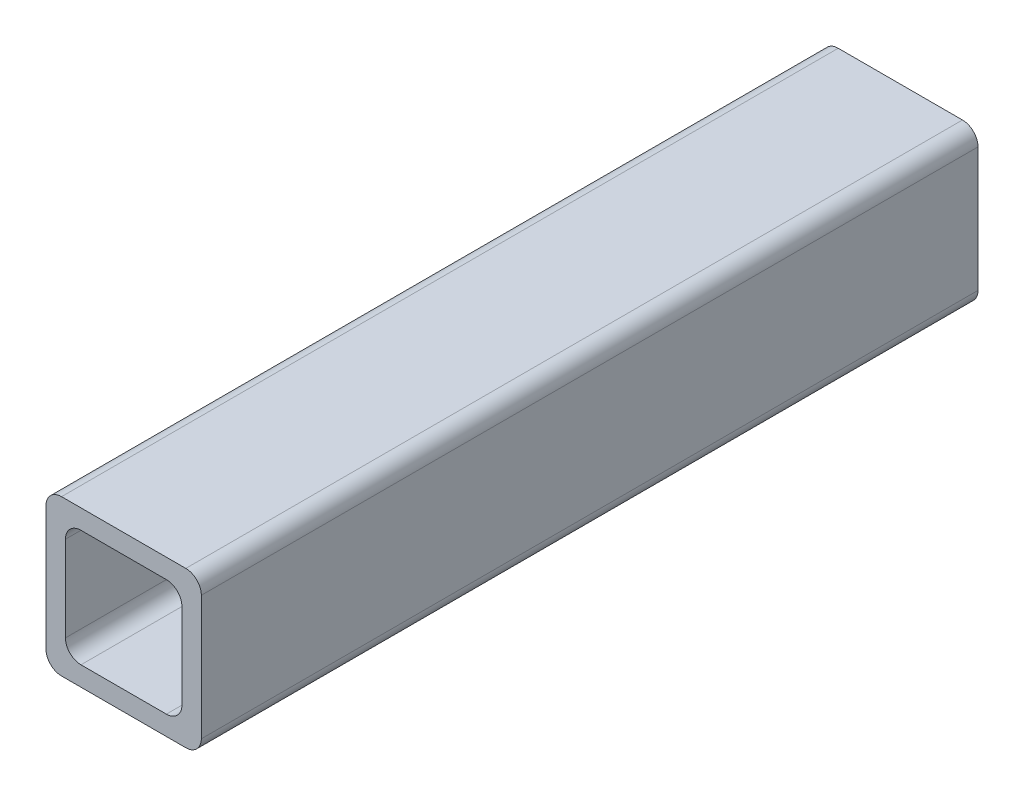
ISO-10303-21;
HEADER;
FILE_DESCRIPTION(('STEP AP214'),'2;1');
FILE_NAME('part.step','',(''),(''),'','','');
FILE_SCHEMA(('AUTOMOTIVE_DESIGN { 1 0 10303 214 1 1 1 1 }'));
ENDSEC;
DATA;
#1=APPLICATION_CONTEXT('core data for automotive mechanical design processes');
#2=APPLICATION_PROTOCOL_DEFINITION('international standard','automotive_design',2000,#1);
#3=PRODUCT_CONTEXT('',#1,'mechanical');
#4=PRODUCT('Part','Part','',(#3));
#5=PRODUCT_RELATED_PRODUCT_CATEGORY('part','',(#4));
#6=PRODUCT_DEFINITION_FORMATION('','',#4);
#7=PRODUCT_DEFINITION_CONTEXT('part definition',#1,'design');
#8=PRODUCT_DEFINITION('design','',#6,#7);
#9=PRODUCT_DEFINITION_SHAPE('','',#8);
#10=(LENGTH_UNIT() NAMED_UNIT(*) SI_UNIT(.MILLI.,.METRE.));
#11=(NAMED_UNIT(*) PLANE_ANGLE_UNIT() SI_UNIT($,.RADIAN.));
#12=(NAMED_UNIT(*) SI_UNIT($,.STERADIAN.) SOLID_ANGLE_UNIT());
#13=UNCERTAINTY_MEASURE_WITH_UNIT(LENGTH_MEASURE(1.E-05),#10,'distance_accuracy_value','');
#14=(GEOMETRIC_REPRESENTATION_CONTEXT(3) GLOBAL_UNCERTAINTY_ASSIGNED_CONTEXT((#13)) GLOBAL_UNIT_ASSIGNED_CONTEXT((#10,
#11,#12)) REPRESENTATION_CONTEXT('',''));
#15=CARTESIAN_POINT('',(0.,0.,0.));
#16=DIRECTION('',(0.,0.,1.));
#17=DIRECTION('',(1.,0.,0.));
#18=AXIS2_PLACEMENT_3D('',#15,#16,#17);
#19=CARTESIAN_POINT('',(-9.50097337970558,-8.,100.));
#20=DIRECTION('',(0.,0.,-1.));
#21=DIRECTION('',(-1.,0.,0.));
#22=AXIS2_PLACEMENT_3D('',#19,#20,#21);
#23=PLANE('',#22);
#24=CARTESIAN_POINT('',(-9.50097337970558,-8.,100.));
#25=DIRECTION('',(0.,0.,1.));
#26=DIRECTION('',(-1.,0.,0.));
#27=AXIS2_PLACEMENT_3D('',#24,#25,#26);
#28=CIRCLE('',#27,2.);
#29=CARTESIAN_POINT('',(-11.5009733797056,-7.99999999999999,100.));
#30=VERTEX_POINT('',#29);
#31=CARTESIAN_POINT('',(-9.50097337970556,-10.,100.));
#32=VERTEX_POINT('',#31);
#33=EDGE_CURVE('E211',#30,#32,#28,.T.);
#34=ORIENTED_EDGE('',*,*,#33,.T.);
#35=DIRECTION('',(1.,0.,0.));
#36=VECTOR('',#35,1.);
#37=CARTESIAN_POINT('',(6.49902662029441,-10.,100.));
#38=LINE('',#37,#36);
#39=CARTESIAN_POINT('',(6.49902662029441,-10.,100.));
#40=VERTEX_POINT('',#39);
#41=EDGE_CURVE('E214',#32,#40,#38,.T.);
#42=ORIENTED_EDGE('',*,*,#41,.T.);
#43=CARTESIAN_POINT('',(6.49902662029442,-8.,100.));
#44=DIRECTION('',(0.,0.,1.));
#45=DIRECTION('',(1.,0.,0.));
#46=AXIS2_PLACEMENT_3D('',#43,#44,#45);
#47=CIRCLE('',#46,2.);
#48=CARTESIAN_POINT('',(8.49902662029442,-7.99999999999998,100.));
#49=VERTEX_POINT('',#48);
#50=EDGE_CURVE('E217',#40,#49,#47,.T.);
#51=ORIENTED_EDGE('',*,*,#50,.T.);
#52=DIRECTION('',(0.,1.,0.));
#53=VECTOR('',#52,1.);
#54=CARTESIAN_POINT('',(8.49902662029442,-7.99999999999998,100.));
#55=LINE('',#54,#53);
#56=CARTESIAN_POINT('',(8.49902662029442,7.99999999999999,100.));
#57=VERTEX_POINT('',#56);
#58=EDGE_CURVE('E219',#49,#57,#55,.T.);
#59=ORIENTED_EDGE('',*,*,#58,.T.);
#60=CARTESIAN_POINT('',(6.49902662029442,8.,100.));
#61=DIRECTION('',(0.,0.,1.));
#62=DIRECTION('',(1.,0.,0.));
#63=AXIS2_PLACEMENT_3D('',#60,#61,#62);
#64=CIRCLE('',#63,2.);
#65=CARTESIAN_POINT('',(6.49902662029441,10.,100.));
#66=VERTEX_POINT('',#65);
#67=EDGE_CURVE('E221',#57,#66,#64,.T.);
#68=ORIENTED_EDGE('',*,*,#67,.T.);
#69=DIRECTION('',(-1.,0.,0.));
#70=VECTOR('',#69,1.);
#71=CARTESIAN_POINT('',(6.49902662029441,10.,100.));
#72=LINE('',#71,#70);
#73=CARTESIAN_POINT('',(-9.50097337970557,10.,100.));
#74=VERTEX_POINT('',#73);
#75=EDGE_CURVE('E223',#66,#74,#72,.T.);
#76=ORIENTED_EDGE('',*,*,#75,.T.);
#77=CARTESIAN_POINT('',(-9.50097337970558,8.,100.));
#78=DIRECTION('',(0.,0.,1.));
#79=DIRECTION('',(1.,0.,0.));
#80=AXIS2_PLACEMENT_3D('',#77,#78,#79);
#81=CIRCLE('',#80,2.);
#82=CARTESIAN_POINT('',(-11.5009733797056,7.99999999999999,100.));
#83=VERTEX_POINT('',#82);
#84=EDGE_CURVE('E225',#74,#83,#81,.T.);
#85=ORIENTED_EDGE('',*,*,#84,.T.);
#86=DIRECTION('',(0.,-1.,0.));
#87=VECTOR('',#86,1.);
#88=CARTESIAN_POINT('',(-11.5009733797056,-7.99999999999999,100.));
#89=LINE('',#88,#87);
#90=EDGE_CURVE('E227',#83,#30,#89,.T.);
#91=ORIENTED_EDGE('',*,*,#90,.T.);
#92=EDGE_LOOP('',(#34,#42,#51,#59,#68,#76,#85,#91));
#93=FACE_BOUND('',#92,.T.);
#94=CARTESIAN_POINT('',(3.99902662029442,-5.5,100.));
#95=DIRECTION('',(0.,0.,1.));
#96=DIRECTION('',(1.,0.,0.));
#97=AXIS2_PLACEMENT_3D('',#94,#95,#96);
#98=CIRCLE('',#97,2.);
#99=CARTESIAN_POINT('',(3.99902662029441,-7.5,100.));
#100=VERTEX_POINT('',#99);
#101=CARTESIAN_POINT('',(5.99902662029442,-5.49999999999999,100.));
#102=VERTEX_POINT('',#101);
#103=EDGE_CURVE('E146',#100,#102,#98,.T.);
#104=ORIENTED_EDGE('',*,*,#103,.F.);
#105=DIRECTION('',(1.,0.,0.));
#106=VECTOR('',#105,1.);
#107=CARTESIAN_POINT('',(3.99902662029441,-7.5,100.));
#108=LINE('',#107,#106);
#109=CARTESIAN_POINT('',(-7.00097337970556,-7.5,100.));
#110=VERTEX_POINT('',#109);
#111=EDGE_CURVE('E179',#110,#100,#108,.T.);
#112=ORIENTED_EDGE('',*,*,#111,.F.);
#113=CARTESIAN_POINT('',(-7.00097337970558,-5.5,100.));
#114=DIRECTION('',(0.,0.,1.));
#115=DIRECTION('',(1.,0.,0.));
#116=AXIS2_PLACEMENT_3D('',#113,#114,#115);
#117=CIRCLE('',#116,2.);
#118=CARTESIAN_POINT('',(-9.00097337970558,-5.49999999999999,100.));
#119=VERTEX_POINT('',#118);
#120=EDGE_CURVE('E177',#119,#110,#117,.T.);
#121=ORIENTED_EDGE('',*,*,#120,.F.);
#122=DIRECTION('',(0.,-1.,0.));
#123=VECTOR('',#122,1.);
#124=CARTESIAN_POINT('',(-9.00097337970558,-5.49999999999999,100.));
#125=LINE('',#124,#123);
#126=CARTESIAN_POINT('',(-9.00097337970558,5.49999999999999,100.));
#127=VERTEX_POINT('',#126);
#128=EDGE_CURVE('E175',#127,#119,#125,.T.);
#129=ORIENTED_EDGE('',*,*,#128,.F.);
#130=CARTESIAN_POINT('',(-7.00097337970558,5.5,100.));
#131=DIRECTION('',(0.,0.,1.));
#132=DIRECTION('',(1.,0.,0.));
#133=AXIS2_PLACEMENT_3D('',#130,#131,#132);
#134=CIRCLE('',#133,2.);
#135=CARTESIAN_POINT('',(-7.00097337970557,7.5,100.));
#136=VERTEX_POINT('',#135);
#137=EDGE_CURVE('E173',#136,#127,#134,.T.);
#138=ORIENTED_EDGE('',*,*,#137,.F.);
#139=DIRECTION('',(-1.,0.,0.));
#140=VECTOR('',#139,1.);
#141=CARTESIAN_POINT('',(3.99902662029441,7.5,100.));
#142=LINE('',#141,#140);
#143=CARTESIAN_POINT('',(3.99902662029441,7.5,100.));
#144=VERTEX_POINT('',#143);
#145=EDGE_CURVE('E169',#144,#136,#142,.T.);
#146=ORIENTED_EDGE('',*,*,#145,.F.);
#147=CARTESIAN_POINT('',(3.99902662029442,5.5,100.));
#148=DIRECTION('',(0.,0.,1.));
#149=DIRECTION('',(-1.,0.,0.));
#150=AXIS2_PLACEMENT_3D('',#147,#148,#149);
#151=CIRCLE('',#150,2.);
#152=CARTESIAN_POINT('',(5.99902662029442,5.49999999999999,100.));
#153=VERTEX_POINT('',#152);
#154=EDGE_CURVE('E167',#153,#144,#151,.T.);
#155=ORIENTED_EDGE('',*,*,#154,.F.);
#156=DIRECTION('',(0.,1.,0.));
#157=VECTOR('',#156,1.);
#158=CARTESIAN_POINT('',(5.99902662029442,-5.49999999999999,100.));
#159=LINE('',#158,#157);
#160=EDGE_CURVE('E154',#102,#153,#159,.T.);
#161=ORIENTED_EDGE('',*,*,#160,.F.);
#162=EDGE_LOOP('',(#104,#112,#121,#129,#138,#146,#155,#161));
#163=FACE_BOUND('',#162,.T.);
#164=ADVANCED_FACE('F33',(#93,#163),#23,.F.);
#165=CARTESIAN_POINT('',(-9.50097337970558,-8.,0.));
#166=DIRECTION('',(0.,0.,-1.));
#167=DIRECTION('',(-1.,0.,0.));
#168=AXIS2_PLACEMENT_3D('',#165,#166,#167);
#169=PLANE('',#168);
#170=CARTESIAN_POINT('',(-9.50097337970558,-8.,0.));
#171=DIRECTION('',(0.,0.,1.));
#172=DIRECTION('',(-1.,0.,0.));
#173=AXIS2_PLACEMENT_3D('',#170,#171,#172);
#174=CIRCLE('',#173,2.);
#175=CARTESIAN_POINT('',(-11.5009733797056,-7.99999999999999,0.));
#176=VERTEX_POINT('',#175);
#177=CARTESIAN_POINT('',(-9.50097337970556,-10.,0.));
#178=VERTEX_POINT('',#177);
#179=EDGE_CURVE('E162',#176,#178,#174,.T.);
#180=ORIENTED_EDGE('',*,*,#179,.F.);
#181=DIRECTION('',(0.,-1.,0.));
#182=VECTOR('',#181,1.);
#183=CARTESIAN_POINT('',(-11.5009733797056,-7.99999999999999,0.));
#184=LINE('',#183,#182);
#185=CARTESIAN_POINT('',(-11.5009733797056,7.99999999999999,0.));
#186=VERTEX_POINT('',#185);
#187=EDGE_CURVE('E215',#186,#176,#184,.T.);
#188=ORIENTED_EDGE('',*,*,#187,.F.);
#189=CARTESIAN_POINT('',(-9.50097337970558,8.,0.));
#190=DIRECTION('',(0.,0.,1.));
#191=DIRECTION('',(1.,0.,0.));
#192=AXIS2_PLACEMENT_3D('',#189,#190,#191);
#193=CIRCLE('',#192,2.);
#194=CARTESIAN_POINT('',(-9.50097337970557,10.,0.));
#195=VERTEX_POINT('',#194);
#196=EDGE_CURVE('E242',#195,#186,#193,.T.);
#197=ORIENTED_EDGE('',*,*,#196,.F.);
#198=DIRECTION('',(-1.,0.,0.));
#199=VECTOR('',#198,1.);
#200=CARTESIAN_POINT('',(6.49902662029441,10.,0.));
#201=LINE('',#200,#199);
#202=CARTESIAN_POINT('',(6.49902662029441,10.,0.));
#203=VERTEX_POINT('',#202);
#204=EDGE_CURVE('E240',#203,#195,#201,.T.);
#205=ORIENTED_EDGE('',*,*,#204,.F.);
#206=CARTESIAN_POINT('',(6.49902662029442,8.,0.));
#207=DIRECTION('',(0.,0.,1.));
#208=DIRECTION('',(1.,0.,0.));
#209=AXIS2_PLACEMENT_3D('',#206,#207,#208);
#210=CIRCLE('',#209,2.);
#211=CARTESIAN_POINT('',(8.49902662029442,7.99999999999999,0.));
#212=VERTEX_POINT('',#211);
#213=EDGE_CURVE('E238',#212,#203,#210,.T.);
#214=ORIENTED_EDGE('',*,*,#213,.F.);
#215=DIRECTION('',(0.,1.,0.));
#216=VECTOR('',#215,1.);
#217=CARTESIAN_POINT('',(8.49902662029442,-7.99999999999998,0.));
#218=LINE('',#217,#216);
#219=CARTESIAN_POINT('',(8.49902662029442,-7.99999999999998,0.));
#220=VERTEX_POINT('',#219);
#221=EDGE_CURVE('E236',#220,#212,#218,.T.);
#222=ORIENTED_EDGE('',*,*,#221,.F.);
#223=CARTESIAN_POINT('',(6.49902662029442,-8.,0.));
#224=DIRECTION('',(0.,0.,1.));
#225=DIRECTION('',(1.,0.,0.));
#226=AXIS2_PLACEMENT_3D('',#223,#224,#225);
#227=CIRCLE('',#226,2.);
#228=CARTESIAN_POINT('',(6.49902662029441,-10.,0.));
#229=VERTEX_POINT('',#228);
#230=EDGE_CURVE('E234',#229,#220,#227,.T.);
#231=ORIENTED_EDGE('',*,*,#230,.F.);
#232=DIRECTION('',(1.,0.,0.));
#233=VECTOR('',#232,1.);
#234=CARTESIAN_POINT('',(6.49902662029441,-10.,0.));
#235=LINE('',#234,#233);
#236=EDGE_CURVE('E232',#178,#229,#235,.T.);
#237=ORIENTED_EDGE('',*,*,#236,.F.);
#238=EDGE_LOOP('',(#180,#188,#197,#205,#214,#222,#231,#237));
#239=FACE_BOUND('',#238,.T.);
#240=DIRECTION('',(1.,0.,0.));
#241=VECTOR('',#240,1.);
#242=CARTESIAN_POINT('',(3.99902662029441,-7.5,0.));
#243=LINE('',#242,#241);
#244=CARTESIAN_POINT('',(-7.00097337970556,-7.5,0.));
#245=VERTEX_POINT('',#244);
#246=CARTESIAN_POINT('',(3.99902662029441,-7.5,0.));
#247=VERTEX_POINT('',#246);
#248=EDGE_CURVE('E155',#245,#247,#243,.T.);
#249=ORIENTED_EDGE('',*,*,#248,.T.);
#250=CARTESIAN_POINT('',(3.99902662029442,-5.5,0.));
#251=DIRECTION('',(0.,0.,1.));
#252=DIRECTION('',(1.,0.,0.));
#253=AXIS2_PLACEMENT_3D('',#250,#251,#252);
#254=CIRCLE('',#253,2.);
#255=CARTESIAN_POINT('',(5.99902662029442,-5.49999999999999,0.));
#256=VERTEX_POINT('',#255);
#257=EDGE_CURVE('E56',#247,#256,#254,.T.);
#258=ORIENTED_EDGE('',*,*,#257,.T.);
#259=DIRECTION('',(0.,1.,0.));
#260=VECTOR('',#259,1.);
#261=CARTESIAN_POINT('',(5.99902662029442,-5.49999999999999,0.));
#262=LINE('',#261,#260);
#263=CARTESIAN_POINT('',(5.99902662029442,5.49999999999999,0.));
#264=VERTEX_POINT('',#263);
#265=EDGE_CURVE('E161',#256,#264,#262,.T.);
#266=ORIENTED_EDGE('',*,*,#265,.T.);
#267=CARTESIAN_POINT('',(3.99902662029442,5.5,0.));
#268=DIRECTION('',(0.,0.,1.));
#269=DIRECTION('',(-1.,0.,0.));
#270=AXIS2_PLACEMENT_3D('',#267,#268,#269);
#271=CIRCLE('',#270,2.);
#272=CARTESIAN_POINT('',(3.99902662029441,7.5,0.));
#273=VERTEX_POINT('',#272);
#274=EDGE_CURVE('E183',#264,#273,#271,.T.);
#275=ORIENTED_EDGE('',*,*,#274,.T.);
#276=DIRECTION('',(-1.,0.,0.));
#277=VECTOR('',#276,1.);
#278=CARTESIAN_POINT('',(3.99902662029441,7.5,0.));
#279=LINE('',#278,#277);
#280=CARTESIAN_POINT('',(-7.00097337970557,7.5,0.));
#281=VERTEX_POINT('',#280);
#282=EDGE_CURVE('E186',#273,#281,#279,.T.);
#283=ORIENTED_EDGE('',*,*,#282,.T.);
#284=CARTESIAN_POINT('',(-7.00097337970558,5.5,0.));
#285=DIRECTION('',(0.,0.,1.));
#286=DIRECTION('',(1.,0.,0.));
#287=AXIS2_PLACEMENT_3D('',#284,#285,#286);
#288=CIRCLE('',#287,2.);
#289=CARTESIAN_POINT('',(-9.00097337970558,5.49999999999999,0.));
#290=VERTEX_POINT('',#289);
#291=EDGE_CURVE('E189',#281,#290,#288,.T.);
#292=ORIENTED_EDGE('',*,*,#291,.T.);
#293=DIRECTION('',(0.,-1.,0.));
#294=VECTOR('',#293,1.);
#295=CARTESIAN_POINT('',(-9.00097337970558,-5.49999999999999,0.));
#296=LINE('',#295,#294);
#297=CARTESIAN_POINT('',(-9.00097337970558,-5.49999999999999,0.));
#298=VERTEX_POINT('',#297);
#299=EDGE_CURVE('E192',#290,#298,#296,.T.);
#300=ORIENTED_EDGE('',*,*,#299,.T.);
#301=CARTESIAN_POINT('',(-7.00097337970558,-5.5,0.));
#302=DIRECTION('',(0.,0.,1.));
#303=DIRECTION('',(1.,0.,0.));
#304=AXIS2_PLACEMENT_3D('',#301,#302,#303);
#305=CIRCLE('',#304,2.);
#306=EDGE_CURVE('E195',#298,#245,#305,.T.);
#307=ORIENTED_EDGE('',*,*,#306,.T.);
#308=EDGE_LOOP('',(#249,#258,#266,#275,#283,#292,#300,#307));
#309=FACE_BOUND('',#308,.T.);
#310=ADVANCED_FACE('F272',(#239,#309),#169,.T.);
#311=CARTESIAN_POINT('',(-9.50097337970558,-8.,100.));
#312=DIRECTION('',(0.,0.,-1.));
#313=DIRECTION('',(-1.,0.,0.));
#314=AXIS2_PLACEMENT_3D('',#311,#312,#313);
#315=CYLINDRICAL_SURFACE('',#314,2.);
#316=ORIENTED_EDGE('',*,*,#179,.T.);
#317=DIRECTION('',(0.,0.,-1.));
#318=VECTOR('',#317,1.);
#319=CARTESIAN_POINT('',(-9.50097337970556,-10.,100.));
#320=LINE('',#319,#318);
#321=EDGE_CURVE('E11',#32,#178,#320,.T.);
#322=ORIENTED_EDGE('',*,*,#321,.F.);
#323=ORIENTED_EDGE('',*,*,#33,.F.);
#324=DIRECTION('',(0.,0.,-1.));
#325=VECTOR('',#324,1.);
#326=CARTESIAN_POINT('',(-11.5009733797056,-7.99999999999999,100.));
#327=LINE('',#326,#325);
#328=EDGE_CURVE('E229',#30,#176,#327,.T.);
#329=ORIENTED_EDGE('',*,*,#328,.T.);
#330=EDGE_LOOP('',(#316,#322,#323,#329));
#331=FACE_BOUND('',#330,.T.);
#332=ADVANCED_FACE('F35',(#331),#315,.T.);
#333=CARTESIAN_POINT('',(6.49902662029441,-10.,100.));
#334=DIRECTION('',(0.,1.,0.));
#335=DIRECTION('',(-1.,0.,0.));
#336=AXIS2_PLACEMENT_3D('',#333,#334,#335);
#337=PLANE('',#336);
#338=ORIENTED_EDGE('',*,*,#236,.T.);
#339=DIRECTION('',(0.,0.,-1.));
#340=VECTOR('',#339,1.);
#341=CARTESIAN_POINT('',(6.49902662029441,-10.,100.));
#342=LINE('',#341,#340);
#343=EDGE_CURVE('E41',#40,#229,#342,.T.);
#344=ORIENTED_EDGE('',*,*,#343,.F.);
#345=ORIENTED_EDGE('',*,*,#41,.F.);
#346=ORIENTED_EDGE('',*,*,#321,.T.);
#347=EDGE_LOOP('',(#338,#344,#345,#346));
#348=FACE_BOUND('',#347,.T.);
#349=ADVANCED_FACE('F289',(#348),#337,.F.);
#350=CARTESIAN_POINT('',(6.49902662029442,-8.,100.));
#351=DIRECTION('',(0.,0.,-1.));
#352=DIRECTION('',(-1.,0.,0.));
#353=AXIS2_PLACEMENT_3D('',#350,#351,#352);
#354=CYLINDRICAL_SURFACE('',#353,2.);
#355=ORIENTED_EDGE('',*,*,#230,.T.);
#356=DIRECTION('',(0.,0.,-1.));
#357=VECTOR('',#356,1.);
#358=CARTESIAN_POINT('',(8.49902662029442,-7.99999999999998,100.));
#359=LINE('',#358,#357);
#360=EDGE_CURVE('E259',#49,#220,#359,.T.);
#361=ORIENTED_EDGE('',*,*,#360,.F.);
#362=ORIENTED_EDGE('',*,*,#50,.F.);
#363=ORIENTED_EDGE('',*,*,#343,.T.);
#364=EDGE_LOOP('',(#355,#361,#362,#363));
#365=FACE_BOUND('',#364,.T.);
#366=ADVANCED_FACE('F266',(#365),#354,.T.);
#367=CARTESIAN_POINT('',(8.49902662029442,-7.99999999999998,100.));
#368=DIRECTION('',(-1.,0.,0.));
#369=DIRECTION('',(0.,0.,1.));
#370=AXIS2_PLACEMENT_3D('',#367,#368,#369);
#371=PLANE('',#370);
#372=ORIENTED_EDGE('',*,*,#221,.T.);
#373=DIRECTION('',(0.,0.,-1.));
#374=VECTOR('',#373,1.);
#375=CARTESIAN_POINT('',(8.49902662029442,7.99999999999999,100.));
#376=LINE('',#375,#374);
#377=EDGE_CURVE('E256',#57,#212,#376,.T.);
#378=ORIENTED_EDGE('',*,*,#377,.F.);
#379=ORIENTED_EDGE('',*,*,#58,.F.);
#380=ORIENTED_EDGE('',*,*,#360,.T.);
#381=EDGE_LOOP('',(#372,#378,#379,#380));
#382=FACE_BOUND('',#381,.T.);
#383=ADVANCED_FACE('F278',(#382),#371,.F.);
#384=CARTESIAN_POINT('',(6.49902662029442,8.,100.));
#385=DIRECTION('',(0.,0.,-1.));
#386=DIRECTION('',(-1.,0.,0.));
#387=AXIS2_PLACEMENT_3D('',#384,#385,#386);
#388=CYLINDRICAL_SURFACE('',#387,2.);
#389=ORIENTED_EDGE('',*,*,#213,.T.);
#390=DIRECTION('',(0.,0.,-1.));
#391=VECTOR('',#390,1.);
#392=CARTESIAN_POINT('',(6.49902662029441,10.,100.));
#393=LINE('',#392,#391);
#394=EDGE_CURVE('E253',#66,#203,#393,.T.);
#395=ORIENTED_EDGE('',*,*,#394,.F.);
#396=ORIENTED_EDGE('',*,*,#67,.F.);
#397=ORIENTED_EDGE('',*,*,#377,.T.);
#398=EDGE_LOOP('',(#389,#395,#396,#397));
#399=FACE_BOUND('',#398,.T.);
#400=ADVANCED_FACE('F282',(#399),#388,.T.);
#401=CARTESIAN_POINT('',(6.49902662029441,10.,100.));
#402=DIRECTION('',(0.,-1.,0.));
#403=DIRECTION('',(1.,0.,0.));
#404=AXIS2_PLACEMENT_3D('',#401,#402,#403);
#405=PLANE('',#404);
#406=ORIENTED_EDGE('',*,*,#204,.T.);
#407=DIRECTION('',(0.,0.,-1.));
#408=VECTOR('',#407,1.);
#409=CARTESIAN_POINT('',(-9.50097337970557,10.,100.));
#410=LINE('',#409,#408);
#411=EDGE_CURVE('E250',#74,#195,#410,.T.);
#412=ORIENTED_EDGE('',*,*,#411,.F.);
#413=ORIENTED_EDGE('',*,*,#75,.F.);
#414=ORIENTED_EDGE('',*,*,#394,.T.);
#415=EDGE_LOOP('',(#406,#412,#413,#414));
#416=FACE_BOUND('',#415,.T.);
#417=ADVANCED_FACE('F302',(#416),#405,.F.);
#418=CARTESIAN_POINT('',(-9.50097337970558,8.,100.));
#419=DIRECTION('',(0.,0.,-1.));
#420=DIRECTION('',(-1.,0.,0.));
#421=AXIS2_PLACEMENT_3D('',#418,#419,#420);
#422=CYLINDRICAL_SURFACE('',#421,2.);
#423=ORIENTED_EDGE('',*,*,#196,.T.);
#424=DIRECTION('',(0.,0.,-1.));
#425=VECTOR('',#424,1.);
#426=CARTESIAN_POINT('',(-11.5009733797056,7.99999999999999,100.));
#427=LINE('',#426,#425);
#428=EDGE_CURVE('E247',#83,#186,#427,.T.);
#429=ORIENTED_EDGE('',*,*,#428,.F.);
#430=ORIENTED_EDGE('',*,*,#84,.F.);
#431=ORIENTED_EDGE('',*,*,#411,.T.);
#432=EDGE_LOOP('',(#423,#429,#430,#431));
#433=FACE_BOUND('',#432,.T.);
#434=ADVANCED_FACE('F300',(#433),#422,.T.);
#435=CARTESIAN_POINT('',(-11.5009733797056,-7.99999999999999,100.));
#436=DIRECTION('',(1.,0.,0.));
#437=DIRECTION('',(0.,0.,-1.));
#438=AXIS2_PLACEMENT_3D('',#435,#436,#437);
#439=PLANE('',#438);
#440=ORIENTED_EDGE('',*,*,#187,.T.);
#441=ORIENTED_EDGE('',*,*,#328,.F.);
#442=ORIENTED_EDGE('',*,*,#90,.F.);
#443=ORIENTED_EDGE('',*,*,#428,.T.);
#444=EDGE_LOOP('',(#440,#441,#442,#443));
#445=FACE_BOUND('',#444,.T.);
#446=ADVANCED_FACE('F295',(#445),#439,.F.);
#447=CARTESIAN_POINT('',(3.99902662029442,-5.5,100.));
#448=DIRECTION('',(0.,0.,-1.));
#449=DIRECTION('',(-1.,0.,0.));
#450=AXIS2_PLACEMENT_3D('',#447,#448,#449);
#451=CYLINDRICAL_SURFACE('',#450,2.);
#452=ORIENTED_EDGE('',*,*,#257,.F.);
#453=DIRECTION('',(0.,0.,-1.));
#454=VECTOR('',#453,1.);
#455=CARTESIAN_POINT('',(3.99902662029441,-7.5,100.));
#456=LINE('',#455,#454);
#457=EDGE_CURVE('E150',#100,#247,#456,.T.);
#458=ORIENTED_EDGE('',*,*,#457,.F.);
#459=ORIENTED_EDGE('',*,*,#103,.T.);
#460=DIRECTION('',(0.,0.,-1.));
#461=VECTOR('',#460,1.);
#462=CARTESIAN_POINT('',(5.99902662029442,-5.49999999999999,100.));
#463=LINE('',#462,#461);
#464=EDGE_CURVE('E149',#102,#256,#463,.T.);
#465=ORIENTED_EDGE('',*,*,#464,.T.);
#466=EDGE_LOOP('',(#452,#458,#459,#465));
#467=FACE_BOUND('',#466,.T.);
#468=ADVANCED_FACE('F148',(#467),#451,.F.);
#469=CARTESIAN_POINT('',(5.99902662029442,-5.49999999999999,100.));
#470=DIRECTION('',(-1.,0.,0.));
#471=DIRECTION('',(0.,0.,1.));
#472=AXIS2_PLACEMENT_3D('',#469,#470,#471);
#473=PLANE('',#472);
#474=ORIENTED_EDGE('',*,*,#265,.F.);
#475=ORIENTED_EDGE('',*,*,#464,.F.);
#476=ORIENTED_EDGE('',*,*,#160,.T.);
#477=DIRECTION('',(0.,0.,-1.));
#478=VECTOR('',#477,1.);
#479=CARTESIAN_POINT('',(5.99902662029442,5.49999999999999,100.));
#480=LINE('',#479,#478);
#481=EDGE_CURVE('E163',#153,#264,#480,.T.);
#482=ORIENTED_EDGE('',*,*,#481,.T.);
#483=EDGE_LOOP('',(#474,#475,#476,#482));
#484=FACE_BOUND('',#483,.T.);
#485=ADVANCED_FACE('F158',(#484),#473,.T.);
#486=CARTESIAN_POINT('',(3.99902662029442,5.5,100.));
#487=DIRECTION('',(0.,0.,-1.));
#488=DIRECTION('',(-1.,0.,0.));
#489=AXIS2_PLACEMENT_3D('',#486,#487,#488);
#490=CYLINDRICAL_SURFACE('',#489,2.);
#491=ORIENTED_EDGE('',*,*,#274,.F.);
#492=ORIENTED_EDGE('',*,*,#481,.F.);
#493=ORIENTED_EDGE('',*,*,#154,.T.);
#494=DIRECTION('',(0.,0.,-1.));
#495=VECTOR('',#494,1.);
#496=CARTESIAN_POINT('',(3.99902662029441,7.5,100.));
#497=LINE('',#496,#495);
#498=EDGE_CURVE('E208',#144,#273,#497,.T.);
#499=ORIENTED_EDGE('',*,*,#498,.T.);
#500=EDGE_LOOP('',(#491,#492,#493,#499));
#501=FACE_BOUND('',#500,.T.);
#502=ADVANCED_FACE('F327',(#501),#490,.F.);
#503=CARTESIAN_POINT('',(3.99902662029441,7.5,100.));
#504=DIRECTION('',(0.,-1.,0.));
#505=DIRECTION('',(1.,0.,0.));
#506=AXIS2_PLACEMENT_3D('',#503,#504,#505);
#507=PLANE('',#506);
#508=ORIENTED_EDGE('',*,*,#282,.F.);
#509=ORIENTED_EDGE('',*,*,#498,.F.);
#510=ORIENTED_EDGE('',*,*,#145,.T.);
#511=DIRECTION('',(0.,0.,-1.));
#512=VECTOR('',#511,1.);
#513=CARTESIAN_POINT('',(-7.00097337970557,7.5,100.));
#514=LINE('',#513,#512);
#515=EDGE_CURVE('E206',#136,#281,#514,.T.);
#516=ORIENTED_EDGE('',*,*,#515,.T.);
#517=EDGE_LOOP('',(#508,#509,#510,#516));
#518=FACE_BOUND('',#517,.T.);
#519=ADVANCED_FACE('F331',(#518),#507,.T.);
#520=CARTESIAN_POINT('',(-7.00097337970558,5.5,100.));
#521=DIRECTION('',(0.,0.,-1.));
#522=DIRECTION('',(-1.,0.,0.));
#523=AXIS2_PLACEMENT_3D('',#520,#521,#522);
#524=CYLINDRICAL_SURFACE('',#523,2.);
#525=ORIENTED_EDGE('',*,*,#291,.F.);
#526=ORIENTED_EDGE('',*,*,#515,.F.);
#527=ORIENTED_EDGE('',*,*,#137,.T.);
#528=DIRECTION('',(0.,0.,-1.));
#529=VECTOR('',#528,1.);
#530=CARTESIAN_POINT('',(-9.00097337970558,5.49999999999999,100.));
#531=LINE('',#530,#529);
#532=EDGE_CURVE('E204',#127,#290,#531,.T.);
#533=ORIENTED_EDGE('',*,*,#532,.T.);
#534=EDGE_LOOP('',(#525,#526,#527,#533));
#535=FACE_BOUND('',#534,.T.);
#536=ADVANCED_FACE('F337',(#535),#524,.F.);
#537=CARTESIAN_POINT('',(-9.00097337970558,-5.49999999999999,100.));
#538=DIRECTION('',(1.,0.,0.));
#539=DIRECTION('',(0.,1.,0.));
#540=AXIS2_PLACEMENT_3D('',#537,#538,#539);
#541=PLANE('',#540);
#542=ORIENTED_EDGE('',*,*,#299,.F.);
#543=ORIENTED_EDGE('',*,*,#532,.F.);
#544=ORIENTED_EDGE('',*,*,#128,.T.);
#545=DIRECTION('',(0.,0.,-1.));
#546=VECTOR('',#545,1.);
#547=CARTESIAN_POINT('',(-9.00097337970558,-5.49999999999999,100.));
#548=LINE('',#547,#546);
#549=EDGE_CURVE('E202',#119,#298,#548,.T.);
#550=ORIENTED_EDGE('',*,*,#549,.T.);
#551=EDGE_LOOP('',(#542,#543,#544,#550));
#552=FACE_BOUND('',#551,.T.);
#553=ADVANCED_FACE('F341',(#552),#541,.T.);
#554=CARTESIAN_POINT('',(-7.00097337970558,-5.5,100.));
#555=DIRECTION('',(0.,0.,-1.));
#556=DIRECTION('',(-1.,0.,0.));
#557=AXIS2_PLACEMENT_3D('',#554,#555,#556);
#558=CYLINDRICAL_SURFACE('',#557,2.);
#559=ORIENTED_EDGE('',*,*,#306,.F.);
#560=ORIENTED_EDGE('',*,*,#549,.F.);
#561=ORIENTED_EDGE('',*,*,#120,.T.);
#562=DIRECTION('',(0.,0.,-1.));
#563=VECTOR('',#562,1.);
#564=CARTESIAN_POINT('',(-7.00097337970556,-7.5,100.));
#565=LINE('',#564,#563);
#566=EDGE_CURVE('E48',#110,#245,#565,.T.);
#567=ORIENTED_EDGE('',*,*,#566,.T.);
#568=EDGE_LOOP('',(#559,#560,#561,#567));
#569=FACE_BOUND('',#568,.T.);
#570=ADVANCED_FACE('F345',(#569),#558,.F.);
#571=CARTESIAN_POINT('',(3.99902662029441,-7.5,100.));
#572=DIRECTION('',(0.,1.,0.));
#573=DIRECTION('',(0.,0.,1.));
#574=AXIS2_PLACEMENT_3D('',#571,#572,#573);
#575=PLANE('',#574);
#576=ORIENTED_EDGE('',*,*,#248,.F.);
#577=ORIENTED_EDGE('',*,*,#566,.F.);
#578=ORIENTED_EDGE('',*,*,#111,.T.);
#579=ORIENTED_EDGE('',*,*,#457,.T.);
#580=EDGE_LOOP('',(#576,#577,#578,#579));
#581=FACE_BOUND('',#580,.T.);
#582=ADVANCED_FACE('F349',(#581),#575,.T.);
#583=CLOSED_SHELL('',(#164,#310,#332,#349,#366,#383,#400,#417,#434,#446,#468,#485,#502,#519,
#536,#553,#570,#582));
#584=MANIFOLD_SOLID_BREP('B2',#583);
#585=ADVANCED_BREP_SHAPE_REPRESENTATION('',(#18,#584),#14);
#586=SHAPE_DEFINITION_REPRESENTATION(#9,#585);
ENDSEC;
END-ISO-10303-21;
